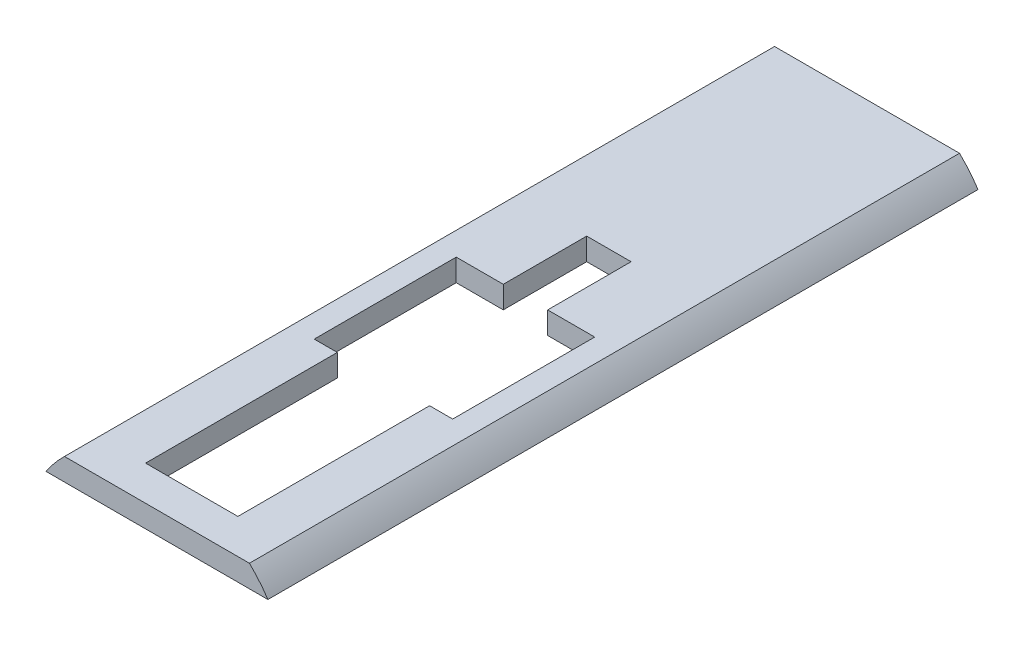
ISO-10303-21;
HEADER;
FILE_DESCRIPTION(('STEP AP214'),'2;1');
FILE_NAME('part.step','',(''),(''),'','','');
FILE_SCHEMA(('AUTOMOTIVE_DESIGN { 1 0 10303 214 1 1 1 1 }'));
ENDSEC;
DATA;
#1=APPLICATION_CONTEXT('core data for automotive mechanical design processes');
#2=APPLICATION_PROTOCOL_DEFINITION('international standard','automotive_design',2000,#1);
#3=PRODUCT_CONTEXT('',#1,'mechanical');
#4=PRODUCT('Part','Part','',(#3));
#5=PRODUCT_RELATED_PRODUCT_CATEGORY('part','',(#4));
#6=PRODUCT_DEFINITION_FORMATION('','',#4);
#7=PRODUCT_DEFINITION_CONTEXT('part definition',#1,'design');
#8=PRODUCT_DEFINITION('design','',#6,#7);
#9=PRODUCT_DEFINITION_SHAPE('','',#8);
#10=(LENGTH_UNIT() NAMED_UNIT(*) SI_UNIT(.MILLI.,.METRE.));
#11=(NAMED_UNIT(*) PLANE_ANGLE_UNIT() SI_UNIT($,.RADIAN.));
#12=(NAMED_UNIT(*) SI_UNIT($,.STERADIAN.) SOLID_ANGLE_UNIT());
#13=UNCERTAINTY_MEASURE_WITH_UNIT(LENGTH_MEASURE(1.E-05),#10,'distance_accuracy_value','');
#14=(GEOMETRIC_REPRESENTATION_CONTEXT(3) GLOBAL_UNCERTAINTY_ASSIGNED_CONTEXT((#13)) GLOBAL_UNIT_ASSIGNED_CONTEXT((#10,
#11,#12)) REPRESENTATION_CONTEXT('',''));
#15=CARTESIAN_POINT('',(0.,0.,0.));
#16=DIRECTION('',(0.,0.,1.));
#17=DIRECTION('',(1.,0.,0.));
#18=AXIS2_PLACEMENT_3D('',#15,#16,#17);
#19=CARTESIAN_POINT('',(0.,0.,101.6));
#20=DIRECTION('',(0.,0.,-1.));
#21=DIRECTION('',(-1.,0.,0.));
#22=AXIS2_PLACEMENT_3D('',#19,#20,#21);
#23=CYLINDRICAL_SURFACE('',#22,19.05);
#24=CARTESIAN_POINT('',(0.,0.,101.6));
#25=DIRECTION('',(0.,0.,1.));
#26=DIRECTION('',(1.,0.,0.));
#27=AXIS2_PLACEMENT_3D('',#24,#25,#26);
#28=CIRCLE('',#27,19.05);
#29=CARTESIAN_POINT('',(15.875,10.5302837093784,101.6));
#30=VERTEX_POINT('',#29);
#31=CARTESIAN_POINT('',(13.2313150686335,13.7052837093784,101.6));
#32=VERTEX_POINT('',#31);
#33=EDGE_CURVE('E39',#30,#32,#28,.T.);
#34=ORIENTED_EDGE('',*,*,#33,.F.);
#35=DIRECTION('',(0.,0.,1.));
#36=VECTOR('',#35,1.);
#37=CARTESIAN_POINT('',(15.875,10.5302837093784,0.));
#38=LINE('',#37,#36);
#39=CARTESIAN_POINT('',(15.875,10.5302837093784,0.));
#40=VERTEX_POINT('',#39);
#41=EDGE_CURVE('E250',#40,#30,#38,.T.);
#42=ORIENTED_EDGE('',*,*,#41,.F.);
#43=CARTESIAN_POINT('',(0.,0.,0.));
#44=DIRECTION('',(0.,0.,1.));
#45=DIRECTION('',(1.,0.,0.));
#46=AXIS2_PLACEMENT_3D('',#43,#44,#45);
#47=CIRCLE('',#46,19.05);
#48=CARTESIAN_POINT('',(13.2313150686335,13.7052837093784,0.));
#49=VERTEX_POINT('',#48);
#50=EDGE_CURVE('E265',#40,#49,#47,.T.);
#51=ORIENTED_EDGE('',*,*,#50,.T.);
#52=DIRECTION('',(0.,0.,1.));
#53=VECTOR('',#52,1.);
#54=CARTESIAN_POINT('',(13.2313150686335,13.7052837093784,0.));
#55=LINE('',#54,#53);
#56=EDGE_CURVE('E262',#49,#32,#55,.T.);
#57=ORIENTED_EDGE('',*,*,#56,.T.);
#58=EDGE_LOOP('',(#34,#42,#51,#57));
#59=FACE_BOUND('',#58,.T.);
#60=ADVANCED_FACE('F31',(#59),#23,.T.);
#61=CARTESIAN_POINT('',(-13.2313150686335,13.7052837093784,0.));
#62=VERTEX_POINT('',#61);
#63=CARTESIAN_POINT('',(-15.875,10.5302837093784,0.));
#64=VERTEX_POINT('',#63);
#65=EDGE_CURVE('E266',#62,#64,#47,.T.);
#66=ORIENTED_EDGE('',*,*,#65,.T.);
#67=DIRECTION('',(0.,0.,1.));
#68=VECTOR('',#67,1.);
#69=CARTESIAN_POINT('',(-15.875,10.5302837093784,0.));
#70=LINE('',#69,#68);
#71=CARTESIAN_POINT('',(-15.875,10.5302837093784,101.6));
#72=VERTEX_POINT('',#71);
#73=EDGE_CURVE('E251',#64,#72,#70,.T.);
#74=ORIENTED_EDGE('',*,*,#73,.T.);
#75=CARTESIAN_POINT('',(-13.2313150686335,13.7052837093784,101.6));
#76=VERTEX_POINT('',#75);
#77=EDGE_CURVE('E11',#76,#72,#28,.T.);
#78=ORIENTED_EDGE('',*,*,#77,.F.);
#79=DIRECTION('',(0.,0.,1.));
#80=VECTOR('',#79,1.);
#81=CARTESIAN_POINT('',(-13.2313150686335,13.7052837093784,0.));
#82=LINE('',#81,#80);
#83=EDGE_CURVE('E261',#62,#76,#82,.T.);
#84=ORIENTED_EDGE('',*,*,#83,.F.);
#85=EDGE_LOOP('',(#66,#74,#78,#84));
#86=FACE_BOUND('',#85,.T.);
#87=ADVANCED_FACE('F33',(#86),#23,.T.);
#88=CARTESIAN_POINT('',(0.,0.,101.6));
#89=DIRECTION('',(0.,0.,1.));
#90=DIRECTION('',(1.,0.,0.));
#91=AXIS2_PLACEMENT_3D('',#88,#89,#90);
#92=PLANE('',#91);
#93=DIRECTION('',(-1.,0.,0.));
#94=VECTOR('',#93,1.);
#95=CARTESIAN_POINT('',(-15.875,10.5302837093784,101.6));
#96=LINE('',#95,#94);
#97=EDGE_CURVE('E227',#30,#72,#96,.T.);
#98=ORIENTED_EDGE('',*,*,#97,.F.);
#99=ORIENTED_EDGE('',*,*,#33,.T.);
#100=DIRECTION('',(1.,0.,0.));
#101=VECTOR('',#100,1.);
#102=CARTESIAN_POINT('',(-13.2313150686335,13.7052837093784,101.6));
#103=LINE('',#102,#101);
#104=EDGE_CURVE('E254',#76,#32,#103,.T.);
#105=ORIENTED_EDGE('',*,*,#104,.F.);
#106=ORIENTED_EDGE('',*,*,#77,.T.);
#107=EDGE_LOOP('',(#98,#99,#105,#106));
#108=FACE_BOUND('',#107,.T.);
#109=ADVANCED_FACE('F284',(#108),#92,.T.);
#110=CARTESIAN_POINT('',(0.,0.,0.));
#111=DIRECTION('',(0.,0.,1.));
#112=DIRECTION('',(1.,0.,0.));
#113=AXIS2_PLACEMENT_3D('',#110,#111,#112);
#114=PLANE('',#113);
#115=ORIENTED_EDGE('',*,*,#50,.F.);
#116=DIRECTION('',(-1.,0.,0.));
#117=VECTOR('',#116,1.);
#118=CARTESIAN_POINT('',(-15.875,10.5302837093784,0.));
#119=LINE('',#118,#117);
#120=EDGE_CURVE('E247',#40,#64,#119,.T.);
#121=ORIENTED_EDGE('',*,*,#120,.T.);
#122=ORIENTED_EDGE('',*,*,#65,.F.);
#123=DIRECTION('',(1.,0.,0.));
#124=VECTOR('',#123,1.);
#125=CARTESIAN_POINT('',(-13.2313150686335,13.7052837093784,0.));
#126=LINE('',#125,#124);
#127=EDGE_CURVE('E258',#62,#49,#126,.T.);
#128=ORIENTED_EDGE('',*,*,#127,.T.);
#129=EDGE_LOOP('',(#115,#121,#122,#128));
#130=FACE_BOUND('',#129,.T.);
#131=ADVANCED_FACE('F278',(#130),#114,.F.);
#132=CARTESIAN_POINT('',(-13.2313150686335,13.7052837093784,0.));
#133=DIRECTION('',(0.,-1.,0.));
#134=DIRECTION('',(0.,0.,-1.));
#135=AXIS2_PLACEMENT_3D('',#132,#133,#134);
#136=PLANE('',#135);
#137=DIRECTION('',(-1.,0.,0.));
#138=VECTOR('',#137,1.);
#139=CARTESIAN_POINT('',(-3.17500000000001,13.7052837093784,36.9351412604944));
#140=LINE('',#139,#138);
#141=CARTESIAN_POINT('',(3.17499999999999,13.7052837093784,36.9351412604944));
#142=VERTEX_POINT('',#141);
#143=CARTESIAN_POINT('',(-3.17500000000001,13.7052837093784,36.9351412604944));
#144=VERTEX_POINT('',#143);
#145=EDGE_CURVE('E155',#142,#144,#140,.T.);
#146=ORIENTED_EDGE('',*,*,#145,.F.);
#147=DIRECTION('',(0.,0.,-1.));
#148=VECTOR('',#147,1.);
#149=CARTESIAN_POINT('',(3.17499999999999,13.7052837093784,48.8731412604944));
#150=LINE('',#149,#148);
#151=CARTESIAN_POINT('',(3.17499999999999,13.7052837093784,48.8731412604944));
#152=VERTEX_POINT('',#151);
#153=EDGE_CURVE('E46',#152,#142,#150,.T.);
#154=ORIENTED_EDGE('',*,*,#153,.F.);
#155=DIRECTION('',(-1.,0.,0.));
#156=VECTOR('',#155,1.);
#157=CARTESIAN_POINT('',(3.17499999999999,13.7052837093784,48.8731412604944));
#158=LINE('',#157,#156);
#159=CARTESIAN_POINT('',(9.90599999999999,13.7052837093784,48.8731412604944));
#160=VERTEX_POINT('',#159);
#161=EDGE_CURVE('E189',#160,#152,#158,.T.);
#162=ORIENTED_EDGE('',*,*,#161,.F.);
#163=DIRECTION('',(0.,0.,-1.));
#164=VECTOR('',#163,1.);
#165=CARTESIAN_POINT('',(9.906,13.7052837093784,69.1931412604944));
#166=LINE('',#165,#164);
#167=CARTESIAN_POINT('',(9.906,13.7052837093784,69.1931412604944));
#168=VERTEX_POINT('',#167);
#169=EDGE_CURVE('E186',#168,#160,#166,.T.);
#170=ORIENTED_EDGE('',*,*,#169,.F.);
#171=DIRECTION('',(1.,0.,0.));
#172=VECTOR('',#171,1.);
#173=CARTESIAN_POINT('',(6.604,13.7052837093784,69.1931412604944));
#174=LINE('',#173,#172);
#175=CARTESIAN_POINT('',(6.604,13.7052837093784,69.1931412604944));
#176=VERTEX_POINT('',#175);
#177=EDGE_CURVE('E183',#176,#168,#174,.T.);
#178=ORIENTED_EDGE('',*,*,#177,.F.);
#179=DIRECTION('',(0.,0.,-1.));
#180=VECTOR('',#179,1.);
#181=CARTESIAN_POINT('',(6.604,13.7052837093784,96.6251412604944));
#182=LINE('',#181,#180);
#183=CARTESIAN_POINT('',(6.604,13.7052837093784,96.6251412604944));
#184=VERTEX_POINT('',#183);
#185=EDGE_CURVE('E180',#184,#176,#182,.T.);
#186=ORIENTED_EDGE('',*,*,#185,.F.);
#187=DIRECTION('',(1.,0.,0.));
#188=VECTOR('',#187,1.);
#189=CARTESIAN_POINT('',(-6.604,13.7052837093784,96.6251412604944));
#190=LINE('',#189,#188);
#191=CARTESIAN_POINT('',(-6.604,13.7052837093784,96.6251412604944));
#192=VERTEX_POINT('',#191);
#193=EDGE_CURVE('E177',#192,#184,#190,.T.);
#194=ORIENTED_EDGE('',*,*,#193,.F.);
#195=DIRECTION('',(0.,0.,1.));
#196=VECTOR('',#195,1.);
#197=CARTESIAN_POINT('',(-6.604,13.7052837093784,96.6251412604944));
#198=LINE('',#197,#196);
#199=CARTESIAN_POINT('',(-6.604,13.7052837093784,69.1931412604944));
#200=VERTEX_POINT('',#199);
#201=EDGE_CURVE('E174',#200,#192,#198,.T.);
#202=ORIENTED_EDGE('',*,*,#201,.F.);
#203=DIRECTION('',(1.,0.,0.));
#204=VECTOR('',#203,1.);
#205=CARTESIAN_POINT('',(-6.604,13.7052837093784,69.1931412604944));
#206=LINE('',#205,#204);
#207=CARTESIAN_POINT('',(-9.906,13.7052837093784,69.1931412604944));
#208=VERTEX_POINT('',#207);
#209=EDGE_CURVE('E171',#208,#200,#206,.T.);
#210=ORIENTED_EDGE('',*,*,#209,.F.);
#211=DIRECTION('',(0.,0.,1.));
#212=VECTOR('',#211,1.);
#213=CARTESIAN_POINT('',(-9.906,13.7052837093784,69.1931412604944));
#214=LINE('',#213,#212);
#215=CARTESIAN_POINT('',(-9.90600000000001,13.7052837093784,48.8731412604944));
#216=VERTEX_POINT('',#215);
#217=EDGE_CURVE('E165',#216,#208,#214,.T.);
#218=ORIENTED_EDGE('',*,*,#217,.F.);
#219=DIRECTION('',(-1.,0.,0.));
#220=VECTOR('',#219,1.);
#221=CARTESIAN_POINT('',(-9.90600000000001,13.7052837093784,48.8731412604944));
#222=LINE('',#221,#220);
#223=CARTESIAN_POINT('',(-3.17500000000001,13.7052837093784,48.8731412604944));
#224=VERTEX_POINT('',#223);
#225=EDGE_CURVE('E163',#224,#216,#222,.T.);
#226=ORIENTED_EDGE('',*,*,#225,.F.);
#227=DIRECTION('',(0.,0.,1.));
#228=VECTOR('',#227,1.);
#229=CARTESIAN_POINT('',(-3.17500000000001,13.7052837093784,48.8731412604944));
#230=LINE('',#229,#228);
#231=EDGE_CURVE('E146',#144,#224,#230,.T.);
#232=ORIENTED_EDGE('',*,*,#231,.F.);
#233=EDGE_LOOP('',(#146,#154,#162,#170,#178,#186,#194,#202,#210,#218,#226,#232));
#234=FACE_BOUND('',#233,.T.);
#235=ORIENTED_EDGE('',*,*,#104,.T.);
#236=ORIENTED_EDGE('',*,*,#56,.F.);
#237=ORIENTED_EDGE('',*,*,#127,.F.);
#238=ORIENTED_EDGE('',*,*,#83,.T.);
#239=EDGE_LOOP('',(#235,#236,#237,#238));
#240=FACE_BOUND('',#239,.T.);
#241=ADVANCED_FACE('F159',(#234,#240),#136,.F.);
#242=CARTESIAN_POINT('',(-15.875,10.5302837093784,0.));
#243=DIRECTION('',(0.,1.,0.));
#244=DIRECTION('',(0.,0.,1.));
#245=AXIS2_PLACEMENT_3D('',#242,#243,#244);
#246=PLANE('',#245);
#247=DIRECTION('',(-1.,0.,0.));
#248=VECTOR('',#247,1.);
#249=CARTESIAN_POINT('',(3.17499999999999,10.5302837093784,48.8731412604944));
#250=LINE('',#249,#248);
#251=CARTESIAN_POINT('',(9.90599999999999,10.5302837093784,48.8731412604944));
#252=VERTEX_POINT('',#251);
#253=CARTESIAN_POINT('',(3.17499999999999,10.5302837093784,48.8731412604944));
#254=VERTEX_POINT('',#253);
#255=EDGE_CURVE('E222',#252,#254,#250,.T.);
#256=ORIENTED_EDGE('',*,*,#255,.T.);
#257=DIRECTION('',(0.,0.,-1.));
#258=VECTOR('',#257,1.);
#259=CARTESIAN_POINT('',(3.17499999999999,10.5302837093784,48.8731412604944));
#260=LINE('',#259,#258);
#261=CARTESIAN_POINT('',(3.17499999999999,10.5302837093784,36.9351412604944));
#262=VERTEX_POINT('',#261);
#263=EDGE_CURVE('E192',#254,#262,#260,.T.);
#264=ORIENTED_EDGE('',*,*,#263,.T.);
#265=DIRECTION('',(-1.,0.,0.));
#266=VECTOR('',#265,1.);
#267=CARTESIAN_POINT('',(-3.17500000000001,10.5302837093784,36.9351412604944));
#268=LINE('',#267,#266);
#269=CARTESIAN_POINT('',(-3.17500000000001,10.5302837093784,36.9351412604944));
#270=VERTEX_POINT('',#269);
#271=EDGE_CURVE('E195',#262,#270,#268,.T.);
#272=ORIENTED_EDGE('',*,*,#271,.T.);
#273=DIRECTION('',(0.,0.,1.));
#274=VECTOR('',#273,1.);
#275=CARTESIAN_POINT('',(-3.17500000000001,10.5302837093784,48.8731412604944));
#276=LINE('',#275,#274);
#277=CARTESIAN_POINT('',(-3.17500000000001,10.5302837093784,48.8731412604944));
#278=VERTEX_POINT('',#277);
#279=EDGE_CURVE('E54',#270,#278,#276,.T.);
#280=ORIENTED_EDGE('',*,*,#279,.T.);
#281=DIRECTION('',(-1.,0.,0.));
#282=VECTOR('',#281,1.);
#283=CARTESIAN_POINT('',(-9.90600000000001,10.5302837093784,48.8731412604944));
#284=LINE('',#283,#282);
#285=CARTESIAN_POINT('',(-9.90600000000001,10.5302837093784,48.8731412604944));
#286=VERTEX_POINT('',#285);
#287=EDGE_CURVE('E198',#278,#286,#284,.T.);
#288=ORIENTED_EDGE('',*,*,#287,.T.);
#289=DIRECTION('',(0.,0.,1.));
#290=VECTOR('',#289,1.);
#291=CARTESIAN_POINT('',(-9.906,10.5302837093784,69.1931412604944));
#292=LINE('',#291,#290);
#293=CARTESIAN_POINT('',(-9.906,10.5302837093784,69.1931412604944));
#294=VERTEX_POINT('',#293);
#295=EDGE_CURVE('E201',#286,#294,#292,.T.);
#296=ORIENTED_EDGE('',*,*,#295,.T.);
#297=DIRECTION('',(1.,0.,0.));
#298=VECTOR('',#297,1.);
#299=CARTESIAN_POINT('',(-6.604,10.5302837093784,69.1931412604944));
#300=LINE('',#299,#298);
#301=CARTESIAN_POINT('',(-6.604,10.5302837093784,69.1931412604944));
#302=VERTEX_POINT('',#301);
#303=EDGE_CURVE('E204',#294,#302,#300,.T.);
#304=ORIENTED_EDGE('',*,*,#303,.T.);
#305=DIRECTION('',(0.,0.,1.));
#306=VECTOR('',#305,1.);
#307=CARTESIAN_POINT('',(-6.604,10.5302837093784,96.6251412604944));
#308=LINE('',#307,#306);
#309=CARTESIAN_POINT('',(-6.604,10.5302837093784,96.6251412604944));
#310=VERTEX_POINT('',#309);
#311=EDGE_CURVE('E207',#302,#310,#308,.T.);
#312=ORIENTED_EDGE('',*,*,#311,.T.);
#313=DIRECTION('',(1.,0.,0.));
#314=VECTOR('',#313,1.);
#315=CARTESIAN_POINT('',(-6.604,10.5302837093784,96.6251412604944));
#316=LINE('',#315,#314);
#317=CARTESIAN_POINT('',(6.604,10.5302837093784,96.6251412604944));
#318=VERTEX_POINT('',#317);
#319=EDGE_CURVE('E210',#310,#318,#316,.T.);
#320=ORIENTED_EDGE('',*,*,#319,.T.);
#321=DIRECTION('',(0.,0.,-1.));
#322=VECTOR('',#321,1.);
#323=CARTESIAN_POINT('',(6.604,10.5302837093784,96.6251412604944));
#324=LINE('',#323,#322);
#325=CARTESIAN_POINT('',(6.604,10.5302837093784,69.1931412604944));
#326=VERTEX_POINT('',#325);
#327=EDGE_CURVE('E213',#318,#326,#324,.T.);
#328=ORIENTED_EDGE('',*,*,#327,.T.);
#329=DIRECTION('',(1.,0.,0.));
#330=VECTOR('',#329,1.);
#331=CARTESIAN_POINT('',(6.604,10.5302837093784,69.1931412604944));
#332=LINE('',#331,#330);
#333=CARTESIAN_POINT('',(9.906,10.5302837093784,69.1931412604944));
#334=VERTEX_POINT('',#333);
#335=EDGE_CURVE('E216',#326,#334,#332,.T.);
#336=ORIENTED_EDGE('',*,*,#335,.T.);
#337=DIRECTION('',(0.,0.,-1.));
#338=VECTOR('',#337,1.);
#339=CARTESIAN_POINT('',(9.906,10.5302837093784,69.1931412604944));
#340=LINE('',#339,#338);
#341=EDGE_CURVE('E219',#334,#252,#340,.T.);
#342=ORIENTED_EDGE('',*,*,#341,.T.);
#343=EDGE_LOOP('',(#256,#264,#272,#280,#288,#296,#304,#312,#320,#328,#336,#342));
#344=FACE_BOUND('',#343,.T.);
#345=ORIENTED_EDGE('',*,*,#97,.T.);
#346=ORIENTED_EDGE('',*,*,#73,.F.);
#347=ORIENTED_EDGE('',*,*,#120,.F.);
#348=ORIENTED_EDGE('',*,*,#41,.T.);
#349=EDGE_LOOP('',(#345,#346,#347,#348));
#350=FACE_BOUND('',#349,.T.);
#351=ADVANCED_FACE('F280',(#344,#350),#246,.F.);
#352=CARTESIAN_POINT('',(3.17499999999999,10.5302837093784,48.8731412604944));
#353=DIRECTION('',(1.,0.,0.));
#354=DIRECTION('',(0.,0.,-1.));
#355=AXIS2_PLACEMENT_3D('',#352,#353,#354);
#356=PLANE('',#355);
#357=ORIENTED_EDGE('',*,*,#153,.T.);
#358=DIRECTION('',(0.,1.,0.));
#359=VECTOR('',#358,1.);
#360=CARTESIAN_POINT('',(3.17499999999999,10.5302837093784,36.9351412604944));
#361=LINE('',#360,#359);
#362=EDGE_CURVE('E152',#262,#142,#361,.T.);
#363=ORIENTED_EDGE('',*,*,#362,.F.);
#364=ORIENTED_EDGE('',*,*,#263,.F.);
#365=DIRECTION('',(0.,1.,0.));
#366=VECTOR('',#365,1.);
#367=CARTESIAN_POINT('',(3.17499999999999,10.5302837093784,48.8731412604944));
#368=LINE('',#367,#366);
#369=EDGE_CURVE('E225',#254,#152,#368,.T.);
#370=ORIENTED_EDGE('',*,*,#369,.T.);
#371=EDGE_LOOP('',(#357,#363,#364,#370));
#372=FACE_BOUND('',#371,.T.);
#373=ADVANCED_FACE('F325',(#372),#356,.F.);
#374=CARTESIAN_POINT('',(3.17499999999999,10.5302837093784,48.8731412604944));
#375=DIRECTION('',(0.,0.,-1.));
#376=DIRECTION('',(-1.,0.,0.));
#377=AXIS2_PLACEMENT_3D('',#374,#375,#376);
#378=PLANE('',#377);
#379=ORIENTED_EDGE('',*,*,#161,.T.);
#380=ORIENTED_EDGE('',*,*,#369,.F.);
#381=ORIENTED_EDGE('',*,*,#255,.F.);
#382=DIRECTION('',(0.,1.,0.));
#383=VECTOR('',#382,1.);
#384=CARTESIAN_POINT('',(9.90599999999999,10.5302837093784,48.8731412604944));
#385=LINE('',#384,#383);
#386=EDGE_CURVE('E228',#252,#160,#385,.T.);
#387=ORIENTED_EDGE('',*,*,#386,.T.);
#388=EDGE_LOOP('',(#379,#380,#381,#387));
#389=FACE_BOUND('',#388,.T.);
#390=ADVANCED_FACE('F335',(#389),#378,.F.);
#391=CARTESIAN_POINT('',(9.906,10.5302837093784,69.1931412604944));
#392=DIRECTION('',(1.,0.,0.));
#393=DIRECTION('',(0.,0.,-1.));
#394=AXIS2_PLACEMENT_3D('',#391,#392,#393);
#395=PLANE('',#394);
#396=ORIENTED_EDGE('',*,*,#169,.T.);
#397=ORIENTED_EDGE('',*,*,#386,.F.);
#398=ORIENTED_EDGE('',*,*,#341,.F.);
#399=DIRECTION('',(0.,1.,0.));
#400=VECTOR('',#399,1.);
#401=CARTESIAN_POINT('',(9.906,10.5302837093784,69.1931412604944));
#402=LINE('',#401,#400);
#403=EDGE_CURVE('E230',#334,#168,#402,.T.);
#404=ORIENTED_EDGE('',*,*,#403,.T.);
#405=EDGE_LOOP('',(#396,#397,#398,#404));
#406=FACE_BOUND('',#405,.T.);
#407=ADVANCED_FACE('F344',(#406),#395,.F.);
#408=CARTESIAN_POINT('',(6.604,10.5302837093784,69.1931412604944));
#409=DIRECTION('',(0.,0.,1.));
#410=DIRECTION('',(1.,0.,0.));
#411=AXIS2_PLACEMENT_3D('',#408,#409,#410);
#412=PLANE('',#411);
#413=ORIENTED_EDGE('',*,*,#177,.T.);
#414=ORIENTED_EDGE('',*,*,#403,.F.);
#415=ORIENTED_EDGE('',*,*,#335,.F.);
#416=DIRECTION('',(0.,1.,0.));
#417=VECTOR('',#416,1.);
#418=CARTESIAN_POINT('',(6.604,10.5302837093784,69.1931412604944));
#419=LINE('',#418,#417);
#420=EDGE_CURVE('E232',#326,#176,#419,.T.);
#421=ORIENTED_EDGE('',*,*,#420,.T.);
#422=EDGE_LOOP('',(#413,#414,#415,#421));
#423=FACE_BOUND('',#422,.T.);
#424=ADVANCED_FACE('F354',(#423),#412,.F.);
#425=CARTESIAN_POINT('',(6.604,10.5302837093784,96.6251412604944));
#426=DIRECTION('',(1.,0.,0.));
#427=DIRECTION('',(0.,0.,-1.));
#428=AXIS2_PLACEMENT_3D('',#425,#426,#427);
#429=PLANE('',#428);
#430=ORIENTED_EDGE('',*,*,#185,.T.);
#431=ORIENTED_EDGE('',*,*,#420,.F.);
#432=ORIENTED_EDGE('',*,*,#327,.F.);
#433=DIRECTION('',(0.,1.,0.));
#434=VECTOR('',#433,1.);
#435=CARTESIAN_POINT('',(6.604,10.5302837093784,96.6251412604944));
#436=LINE('',#435,#434);
#437=EDGE_CURVE('E234',#318,#184,#436,.T.);
#438=ORIENTED_EDGE('',*,*,#437,.T.);
#439=EDGE_LOOP('',(#430,#431,#432,#438));
#440=FACE_BOUND('',#439,.T.);
#441=ADVANCED_FACE('F364',(#440),#429,.F.);
#442=CARTESIAN_POINT('',(-6.604,10.5302837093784,96.6251412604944));
#443=DIRECTION('',(0.,0.,1.));
#444=DIRECTION('',(1.,0.,0.));
#445=AXIS2_PLACEMENT_3D('',#442,#443,#444);
#446=PLANE('',#445);
#447=ORIENTED_EDGE('',*,*,#193,.T.);
#448=ORIENTED_EDGE('',*,*,#437,.F.);
#449=ORIENTED_EDGE('',*,*,#319,.F.);
#450=DIRECTION('',(0.,1.,0.));
#451=VECTOR('',#450,1.);
#452=CARTESIAN_POINT('',(-6.604,10.5302837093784,96.6251412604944));
#453=LINE('',#452,#451);
#454=EDGE_CURVE('E236',#310,#192,#453,.T.);
#455=ORIENTED_EDGE('',*,*,#454,.T.);
#456=EDGE_LOOP('',(#447,#448,#449,#455));
#457=FACE_BOUND('',#456,.T.);
#458=ADVANCED_FACE('F374',(#457),#446,.F.);
#459=CARTESIAN_POINT('',(-6.604,10.5302837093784,96.6251412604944));
#460=DIRECTION('',(-1.,0.,0.));
#461=DIRECTION('',(0.,0.,1.));
#462=AXIS2_PLACEMENT_3D('',#459,#460,#461);
#463=PLANE('',#462);
#464=ORIENTED_EDGE('',*,*,#201,.T.);
#465=ORIENTED_EDGE('',*,*,#454,.F.);
#466=ORIENTED_EDGE('',*,*,#311,.F.);
#467=DIRECTION('',(0.,1.,0.));
#468=VECTOR('',#467,1.);
#469=CARTESIAN_POINT('',(-6.604,10.5302837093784,69.1931412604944));
#470=LINE('',#469,#468);
#471=EDGE_CURVE('E238',#302,#200,#470,.T.);
#472=ORIENTED_EDGE('',*,*,#471,.T.);
#473=EDGE_LOOP('',(#464,#465,#466,#472));
#474=FACE_BOUND('',#473,.T.);
#475=ADVANCED_FACE('F384',(#474),#463,.F.);
#476=CARTESIAN_POINT('',(-6.604,10.5302837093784,69.1931412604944));
#477=DIRECTION('',(0.,0.,1.));
#478=DIRECTION('',(1.,0.,0.));
#479=AXIS2_PLACEMENT_3D('',#476,#477,#478);
#480=PLANE('',#479);
#481=ORIENTED_EDGE('',*,*,#209,.T.);
#482=ORIENTED_EDGE('',*,*,#471,.F.);
#483=ORIENTED_EDGE('',*,*,#303,.F.);
#484=DIRECTION('',(0.,1.,0.));
#485=VECTOR('',#484,1.);
#486=CARTESIAN_POINT('',(-9.906,10.5302837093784,69.1931412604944));
#487=LINE('',#486,#485);
#488=EDGE_CURVE('E240',#294,#208,#487,.T.);
#489=ORIENTED_EDGE('',*,*,#488,.T.);
#490=EDGE_LOOP('',(#481,#482,#483,#489));
#491=FACE_BOUND('',#490,.T.);
#492=ADVANCED_FACE('F394',(#491),#480,.F.);
#493=CARTESIAN_POINT('',(-9.906,10.5302837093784,69.1931412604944));
#494=DIRECTION('',(-1.,0.,0.));
#495=DIRECTION('',(0.,0.,1.));
#496=AXIS2_PLACEMENT_3D('',#493,#494,#495);
#497=PLANE('',#496);
#498=ORIENTED_EDGE('',*,*,#217,.T.);
#499=ORIENTED_EDGE('',*,*,#488,.F.);
#500=ORIENTED_EDGE('',*,*,#295,.F.);
#501=DIRECTION('',(0.,1.,0.));
#502=VECTOR('',#501,1.);
#503=CARTESIAN_POINT('',(-9.90600000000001,10.5302837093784,48.8731412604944));
#504=LINE('',#503,#502);
#505=EDGE_CURVE('E242',#286,#216,#504,.T.);
#506=ORIENTED_EDGE('',*,*,#505,.T.);
#507=EDGE_LOOP('',(#498,#499,#500,#506));
#508=FACE_BOUND('',#507,.T.);
#509=ADVANCED_FACE('F404',(#508),#497,.F.);
#510=CARTESIAN_POINT('',(-9.90600000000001,10.5302837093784,48.8731412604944));
#511=DIRECTION('',(0.,0.,-1.));
#512=DIRECTION('',(-1.,0.,0.));
#513=AXIS2_PLACEMENT_3D('',#510,#511,#512);
#514=PLANE('',#513);
#515=ORIENTED_EDGE('',*,*,#225,.T.);
#516=ORIENTED_EDGE('',*,*,#505,.F.);
#517=ORIENTED_EDGE('',*,*,#287,.F.);
#518=DIRECTION('',(0.,1.,0.));
#519=VECTOR('',#518,1.);
#520=CARTESIAN_POINT('',(-3.17500000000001,10.5302837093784,48.8731412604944));
#521=LINE('',#520,#519);
#522=EDGE_CURVE('E151',#278,#224,#521,.T.);
#523=ORIENTED_EDGE('',*,*,#522,.T.);
#524=EDGE_LOOP('',(#515,#516,#517,#523));
#525=FACE_BOUND('',#524,.T.);
#526=ADVANCED_FACE('F414',(#525),#514,.F.);
#527=CARTESIAN_POINT('',(-3.17500000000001,10.5302837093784,48.8731412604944));
#528=DIRECTION('',(-1.,0.,0.));
#529=DIRECTION('',(0.,0.,1.));
#530=AXIS2_PLACEMENT_3D('',#527,#528,#529);
#531=PLANE('',#530);
#532=ORIENTED_EDGE('',*,*,#231,.T.);
#533=ORIENTED_EDGE('',*,*,#522,.F.);
#534=ORIENTED_EDGE('',*,*,#279,.F.);
#535=DIRECTION('',(0.,1.,0.));
#536=VECTOR('',#535,1.);
#537=CARTESIAN_POINT('',(-3.17500000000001,10.5302837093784,36.9351412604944));
#538=LINE('',#537,#536);
#539=EDGE_CURVE('E142',#270,#144,#538,.T.);
#540=ORIENTED_EDGE('',*,*,#539,.T.);
#541=EDGE_LOOP('',(#532,#533,#534,#540));
#542=FACE_BOUND('',#541,.T.);
#543=ADVANCED_FACE('F144',(#542),#531,.F.);
#544=CARTESIAN_POINT('',(-3.17500000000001,10.5302837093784,36.9351412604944));
#545=DIRECTION('',(0.,0.,-1.));
#546=DIRECTION('',(-1.,0.,0.));
#547=AXIS2_PLACEMENT_3D('',#544,#545,#546);
#548=PLANE('',#547);
#549=ORIENTED_EDGE('',*,*,#145,.T.);
#550=ORIENTED_EDGE('',*,*,#539,.F.);
#551=ORIENTED_EDGE('',*,*,#271,.F.);
#552=ORIENTED_EDGE('',*,*,#362,.T.);
#553=EDGE_LOOP('',(#549,#550,#551,#552));
#554=FACE_BOUND('',#553,.T.);
#555=ADVANCED_FACE('F156',(#554),#548,.F.);
#556=CLOSED_SHELL('',(#60,#87,#109,#131,#241,#351,#373,#390,#407,#424,#441,#458,#475,#492,#509,
#526,#543,#555));
#557=MANIFOLD_SOLID_BREP('B2',#556);
#558=ADVANCED_BREP_SHAPE_REPRESENTATION('',(#18,#557),#14);
#559=SHAPE_DEFINITION_REPRESENTATION(#9,#558);
ENDSEC;
END-ISO-10303-21;
